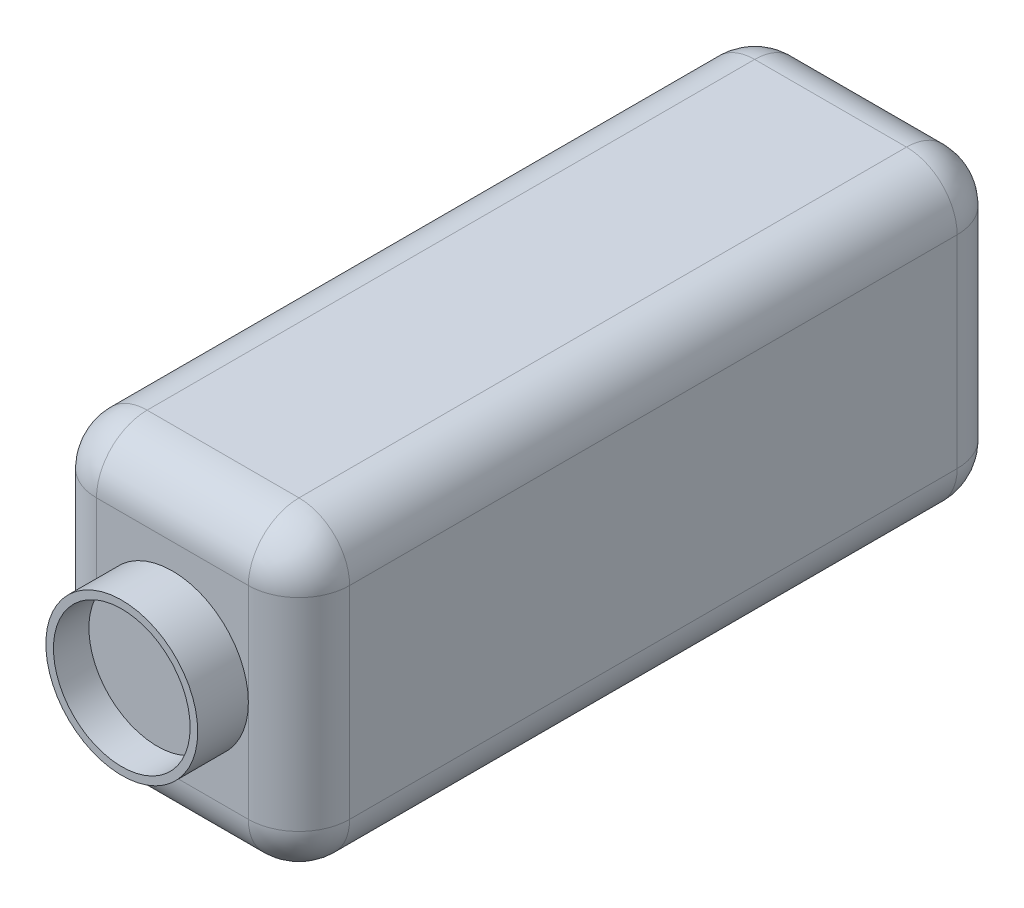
ISO-10303-21;
HEADER;
FILE_DESCRIPTION(('STEP AP214'),'2;1');
FILE_NAME('part.step','',(''),(''),'','','');
FILE_SCHEMA(('AUTOMOTIVE_DESIGN { 1 0 10303 214 1 1 1 1 }'));
ENDSEC;
DATA;
#1=APPLICATION_CONTEXT('core data for automotive mechanical design processes');
#2=APPLICATION_PROTOCOL_DEFINITION('international standard','automotive_design',2000,#1);
#3=PRODUCT_CONTEXT('',#1,'mechanical');
#4=PRODUCT('Part','Part','',(#3));
#5=PRODUCT_RELATED_PRODUCT_CATEGORY('part','',(#4));
#6=PRODUCT_DEFINITION_FORMATION('','',#4);
#7=PRODUCT_DEFINITION_CONTEXT('part definition',#1,'design');
#8=PRODUCT_DEFINITION('design','',#6,#7);
#9=PRODUCT_DEFINITION_SHAPE('','',#8);
#10=(LENGTH_UNIT() NAMED_UNIT(*) SI_UNIT(.MILLI.,.METRE.));
#11=(NAMED_UNIT(*) PLANE_ANGLE_UNIT() SI_UNIT($,.RADIAN.));
#12=(NAMED_UNIT(*) SI_UNIT($,.STERADIAN.) SOLID_ANGLE_UNIT());
#13=UNCERTAINTY_MEASURE_WITH_UNIT(LENGTH_MEASURE(1.E-05),#10,'distance_accuracy_value','');
#14=(GEOMETRIC_REPRESENTATION_CONTEXT(3) GLOBAL_UNCERTAINTY_ASSIGNED_CONTEXT((#13)) GLOBAL_UNIT_ASSIGNED_CONTEXT((#10,
#11,#12)) REPRESENTATION_CONTEXT('',''));
#15=CARTESIAN_POINT('',(0.,0.,0.));
#16=DIRECTION('',(0.,0.,1.));
#17=DIRECTION('',(1.,0.,0.));
#18=AXIS2_PLACEMENT_3D('',#15,#16,#17);
#19=CARTESIAN_POINT('',(0.,0.,0.));
#20=DIRECTION('',(0.,0.,-1.));
#21=DIRECTION('',(-1.,0.,0.));
#22=AXIS2_PLACEMENT_3D('',#19,#20,#21);
#23=PLANE('',#22);
#24=DIRECTION('',(0.,-1.,0.));
#25=VECTOR('',#24,1.);
#26=CARTESIAN_POINT('',(15.,0.,0.));
#27=LINE('',#26,#25);
#28=CARTESIAN_POINT('',(15.,0.,0.));
#29=VERTEX_POINT('',#28);
#30=CARTESIAN_POINT('',(15.,20.,0.));
#31=VERTEX_POINT('',#30);
#32=EDGE_CURVE('E193',#29,#31,#27,.F.);
#33=ORIENTED_EDGE('',*,*,#32,.T.);
#34=DIRECTION('',(1.,0.,0.));
#35=VECTOR('',#34,1.);
#36=CARTESIAN_POINT('',(0.,20.,0.));
#37=LINE('',#36,#35);
#38=CARTESIAN_POINT('',(-15.,20.,0.));
#39=VERTEX_POINT('',#38);
#40=EDGE_CURVE('E195',#31,#39,#37,.F.);
#41=ORIENTED_EDGE('',*,*,#40,.T.);
#42=DIRECTION('',(0.,1.,0.));
#43=VECTOR('',#42,1.);
#44=CARTESIAN_POINT('',(-15.,0.,0.));
#45=LINE('',#44,#43);
#46=CARTESIAN_POINT('',(-15.,0.,0.));
#47=VERTEX_POINT('',#46);
#48=EDGE_CURVE('E154',#39,#47,#45,.F.);
#49=ORIENTED_EDGE('',*,*,#48,.T.);
#50=CARTESIAN_POINT('',(0.,0.,0.));
#51=DIRECTION('',(0.,0.,1.));
#52=DIRECTION('',(1.,0.,0.));
#53=AXIS2_PLACEMENT_3D('',#50,#51,#52);
#54=CIRCLE('',#53,15.);
#55=EDGE_CURVE('E288',#29,#47,#54,.T.);
#56=ORIENTED_EDGE('',*,*,#55,.F.);
#57=EDGE_LOOP('',(#33,#41,#49,#56));
#58=FACE_BOUND('',#57,.T.);
#59=ADVANCED_FACE('F48',(#58),#23,.F.);
#60=CARTESIAN_POINT('',(0.,0.,10.));
#61=DIRECTION('',(0.,0.,-1.));
#62=DIRECTION('',(-1.,0.,0.));
#63=AXIS2_PLACEMENT_3D('',#60,#61,#62);
#64=CYLINDRICAL_SURFACE('',#63,15.);
#65=CARTESIAN_POINT('',(0.,0.,10.));
#66=DIRECTION('',(0.,0.,1.));
#67=DIRECTION('',(1.,0.,0.));
#68=AXIS2_PLACEMENT_3D('',#65,#66,#67);
#69=CIRCLE('',#68,15.);
#70=CARTESIAN_POINT('',(15.,0.,10.));
#71=VERTEX_POINT('',#70);
#72=EDGE_CURVE('E176',#71,#71,#69,.T.);
#73=ORIENTED_EDGE('',*,*,#72,.F.);
#74=EDGE_LOOP('',(#73));
#75=FACE_BOUND('',#74,.T.);
#76=ORIENTED_EDGE('',*,*,#55,.T.);
#77=EDGE_CURVE('E282',#47,#29,#54,.T.);
#78=ORIENTED_EDGE('',*,*,#77,.T.);
#79=EDGE_LOOP('',(#76,#78));
#80=FACE_BOUND('',#79,.T.);
#81=ADVANCED_FACE('F309',(#75,#80),#64,.T.);
#82=CARTESIAN_POINT('',(0.,0.,10.));
#83=DIRECTION('',(0.,0.,1.));
#84=DIRECTION('',(1.,0.,0.));
#85=AXIS2_PLACEMENT_3D('',#82,#83,#84);
#86=PLANE('',#85);
#87=CARTESIAN_POINT('',(0.,0.,10.));
#88=DIRECTION('',(0.,0.,1.));
#89=DIRECTION('',(1.,0.,0.));
#90=AXIS2_PLACEMENT_3D('',#87,#88,#89);
#91=CIRCLE('',#90,13.5);
#92=CARTESIAN_POINT('',(13.5,0.,9.99999999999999));
#93=VERTEX_POINT('',#92);
#94=EDGE_CURVE('E294',#93,#93,#91,.T.);
#95=ORIENTED_EDGE('',*,*,#94,.F.);
#96=EDGE_LOOP('',(#95));
#97=FACE_BOUND('',#96,.T.);
#98=ORIENTED_EDGE('',*,*,#72,.T.);
#99=EDGE_LOOP('',(#98));
#100=FACE_BOUND('',#99,.T.);
#101=ADVANCED_FACE('F306',(#97,#100),#86,.T.);
#102=CARTESIAN_POINT('',(0.,0.,-38.1837661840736));
#103=DIRECTION('',(0.,0.,1.));
#104=DIRECTION('',(1.,0.,0.));
#105=AXIS2_PLACEMENT_3D('',#102,#103,#104);
#106=CYLINDRICAL_SURFACE('',#105,13.5);
#107=CARTESIAN_POINT('',(0.,0.,3.));
#108=DIRECTION('',(0.,0.,1.));
#109=DIRECTION('',(1.,0.,0.));
#110=AXIS2_PLACEMENT_3D('',#107,#108,#109);
#111=CIRCLE('',#110,13.5);
#112=CARTESIAN_POINT('',(13.5,0.,3.));
#113=VERTEX_POINT('',#112);
#114=EDGE_CURVE('E298',#113,#113,#111,.F.);
#115=CARTESIAN_POINT('',(13.5,0.,3.));
#116=CARTESIAN_POINT('',(13.5,0.,3.07291666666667));
#117=CARTESIAN_POINT('',(13.5,0.,3.14583333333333));
#118=CARTESIAN_POINT('',(13.5,0.,3.29166666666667));
#119=CARTESIAN_POINT('',(13.5,0.,3.36458333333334));
#120=CARTESIAN_POINT('',(13.5,0.,3.51041666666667));
#121=CARTESIAN_POINT('',(13.5,0.,3.58333333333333));
#122=CARTESIAN_POINT('',(13.5,0.,3.72916666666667));
#123=CARTESIAN_POINT('',(13.5,0.,3.80208333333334));
#124=CARTESIAN_POINT('',(13.5,0.,3.94791666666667));
#125=CARTESIAN_POINT('',(13.5,0.,4.02083333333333));
#126=CARTESIAN_POINT('',(13.5,0.,4.16666666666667));
#127=CARTESIAN_POINT('',(13.5,0.,4.23958333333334));
#128=CARTESIAN_POINT('',(13.5,0.,4.38541666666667));
#129=CARTESIAN_POINT('',(13.5,0.,4.45833333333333));
#130=CARTESIAN_POINT('',(13.5,0.,4.60416666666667));
#131=CARTESIAN_POINT('',(13.5,0.,4.67708333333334));
#132=CARTESIAN_POINT('',(13.5,0.,4.82291666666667));
#133=CARTESIAN_POINT('',(13.5,0.,4.89583333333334));
#134=CARTESIAN_POINT('',(13.5,0.,5.04166666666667));
#135=CARTESIAN_POINT('',(13.5,0.,5.11458333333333));
#136=CARTESIAN_POINT('',(13.5,0.,5.26041666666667));
#137=CARTESIAN_POINT('',(13.5,0.,5.33333333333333));
#138=CARTESIAN_POINT('',(13.5,0.,5.47916666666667));
#139=CARTESIAN_POINT('',(13.5,0.,5.55208333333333));
#140=CARTESIAN_POINT('',(13.5,0.,5.69791666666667));
#141=CARTESIAN_POINT('',(13.5,0.,5.77083333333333));
#142=CARTESIAN_POINT('',(13.5,0.,5.91666666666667));
#143=CARTESIAN_POINT('',(13.5,0.,5.98958333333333));
#144=CARTESIAN_POINT('',(13.5,0.,6.13541666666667));
#145=CARTESIAN_POINT('',(13.5,0.,6.20833333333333));
#146=CARTESIAN_POINT('',(13.5,0.,6.35416666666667));
#147=CARTESIAN_POINT('',(13.5,0.,6.42708333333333));
#148=CARTESIAN_POINT('',(13.5,0.,6.57291666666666));
#149=CARTESIAN_POINT('',(13.5,0.,6.64583333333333));
#150=CARTESIAN_POINT('',(13.5,0.,6.79166666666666));
#151=CARTESIAN_POINT('',(13.5,0.,6.86458333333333));
#152=CARTESIAN_POINT('',(13.5,0.,7.01041666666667));
#153=CARTESIAN_POINT('',(13.5,0.,7.08333333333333));
#154=CARTESIAN_POINT('',(13.5,0.,7.22916666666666));
#155=CARTESIAN_POINT('',(13.5,0.,7.30208333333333));
#156=CARTESIAN_POINT('',(13.5,0.,7.44791666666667));
#157=CARTESIAN_POINT('',(13.5,0.,7.52083333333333));
#158=CARTESIAN_POINT('',(13.5,0.,7.66666666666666));
#159=CARTESIAN_POINT('',(13.5,0.,7.73958333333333));
#160=CARTESIAN_POINT('',(13.5,0.,7.88541666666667));
#161=CARTESIAN_POINT('',(13.5,0.,7.95833333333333));
#162=CARTESIAN_POINT('',(13.5,0.,8.10416666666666));
#163=CARTESIAN_POINT('',(13.5,0.,8.17708333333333));
#164=CARTESIAN_POINT('',(13.5,0.,8.32291666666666));
#165=CARTESIAN_POINT('',(13.5,0.,8.39583333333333));
#166=CARTESIAN_POINT('',(13.5,0.,8.54166666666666));
#167=CARTESIAN_POINT('',(13.5,0.,8.61458333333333));
#168=CARTESIAN_POINT('',(13.5,0.,8.76041666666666));
#169=CARTESIAN_POINT('',(13.5,0.,8.83333333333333));
#170=CARTESIAN_POINT('',(13.5,0.,8.97916666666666));
#171=CARTESIAN_POINT('',(13.5,0.,9.05208333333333));
#172=CARTESIAN_POINT('',(13.5,0.,9.19791666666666));
#173=CARTESIAN_POINT('',(13.5,0.,9.27083333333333));
#174=CARTESIAN_POINT('',(13.5,0.,9.41666666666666));
#175=CARTESIAN_POINT('',(13.5,0.,9.48958333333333));
#176=CARTESIAN_POINT('',(13.5,0.,9.63541666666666));
#177=CARTESIAN_POINT('',(13.5,0.,9.70833333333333));
#178=CARTESIAN_POINT('',(13.5,0.,9.85416666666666));
#179=CARTESIAN_POINT('',(13.5,0.,9.92708333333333));
#180=CARTESIAN_POINT('',(13.5,0.,9.99999999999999));
#181=B_SPLINE_CURVE_WITH_KNOTS('',3,(#115,#116,#117,#118,#119,#120,#121,#122,#123,#124,#125,
#126,#127,#128,#129,#130,#131,#132,#133,#134,#135,#136,#137,#138,#139,#140,#141,#142,#143,#144,
#145,#146,#147,#148,#149,#150,#151,#152,#153,#154,#155,#156,#157,#158,#159,#160,#161,#162,#163,
#164,#165,#166,#167,#168,#169,#170,#171,#172,#173,#174,#175,#176,#177,#178,#179,#180),
.UNSPECIFIED.,.F.,.F.,(4,2,2,2,2,2,2,2,2,2,2,2,2,2,2,2,2,2,2,2,2,2,2,2,2,2,2,2,2,2,2,2,4),(0.,
0.218749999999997,0.4375,0.656249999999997,0.875000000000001,1.09375,1.3125,1.53125,1.75,
1.96875,2.1875,2.40625,2.625,2.84375,3.0625,3.28125,3.5,3.71874999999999,3.9375,
4.15624999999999,4.375,4.59374999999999,4.8125,5.03124999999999,5.24999999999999,
5.46874999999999,5.68749999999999,5.90624999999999,6.12499999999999,6.34375,6.56249999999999,
6.78124999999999,6.99999999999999),.UNSPECIFIED.);
#182=EDGE_CURVE('BSEAM304',#113,#93,#181,.T.);
#183=ORIENTED_EDGE('',*,*,#114,.T.);
#184=ORIENTED_EDGE('',*,*,#94,.T.);
#185=ORIENTED_EDGE('',*,*,#182,.T.);
#186=ORIENTED_EDGE('',*,*,#182,.F.);
#187=EDGE_LOOP('',(#183,#185,#184,#186));
#188=FACE_BOUND('',#187,.T.);
#189=ADVANCED_FACE('F304',(#188),#106,.F.);
#190=CARTESIAN_POINT('',(0.,0.,3.));
#191=DIRECTION('',(0.,0.,1.));
#192=DIRECTION('',(1.,0.,0.));
#193=AXIS2_PLACEMENT_3D('',#190,#191,#192);
#194=PLANE('',#193);
#195=ORIENTED_EDGE('',*,*,#114,.F.);
#196=EDGE_LOOP('',(#195));
#197=FACE_BOUND('',#196,.T.);
#198=ADVANCED_FACE('F441',(#197),#194,.T.);
#199=CARTESIAN_POINT('',(-25.,30.,-140.));
#200=DIRECTION('',(1.,0.,0.));
#201=DIRECTION('',(0.,1.,0.));
#202=AXIS2_PLACEMENT_3D('',#199,#200,#201);
#203=PLANE('',#202);
#204=DIRECTION('',(0.,1.,0.));
#205=VECTOR('',#204,1.);
#206=CARTESIAN_POINT('',(-25.,-30.,-130.));
#207=LINE('',#206,#205);
#208=CARTESIAN_POINT('',(-25.,20.,-130.));
#209=VERTEX_POINT('',#208);
#210=CARTESIAN_POINT('',(-25.,-20.,-130.));
#211=VERTEX_POINT('',#210);
#212=EDGE_CURVE('E175',#209,#211,#207,.F.);
#213=ORIENTED_EDGE('',*,*,#212,.T.);
#214=DIRECTION('',(0.,0.,1.));
#215=VECTOR('',#214,1.);
#216=CARTESIAN_POINT('',(-25.,-20.,-140.));
#217=LINE('',#216,#215);
#218=CARTESIAN_POINT('',(-25.,-20.,-10.));
#219=VERTEX_POINT('',#218);
#220=EDGE_CURVE('E180',#211,#219,#217,.T.);
#221=ORIENTED_EDGE('',*,*,#220,.T.);
#222=DIRECTION('',(0.,1.,0.));
#223=VECTOR('',#222,1.);
#224=CARTESIAN_POINT('',(-25.,30.,-10.));
#225=LINE('',#224,#223);
#226=CARTESIAN_POINT('',(-25.,20.,-10.));
#227=VERTEX_POINT('',#226);
#228=EDGE_CURVE('E152',#219,#227,#225,.T.);
#229=ORIENTED_EDGE('',*,*,#228,.T.);
#230=DIRECTION('',(0.,0.,1.));
#231=VECTOR('',#230,1.);
#232=CARTESIAN_POINT('',(-25.,20.,-140.));
#233=LINE('',#232,#231);
#234=EDGE_CURVE('E170',#227,#209,#233,.F.);
#235=ORIENTED_EDGE('',*,*,#234,.T.);
#236=EDGE_LOOP('',(#213,#221,#229,#235));
#237=FACE_BOUND('',#236,.T.);
#238=ADVANCED_FACE('F178',(#237),#203,.F.);
#239=CARTESIAN_POINT('',(25.,30.,-140.));
#240=DIRECTION('',(0.,-1.,0.));
#241=DIRECTION('',(1.,0.,0.));
#242=AXIS2_PLACEMENT_3D('',#239,#240,#241);
#243=PLANE('',#242);
#244=DIRECTION('',(1.,0.,0.));
#245=VECTOR('',#244,1.);
#246=CARTESIAN_POINT('',(-25.,30.,-130.));
#247=LINE('',#246,#245);
#248=CARTESIAN_POINT('',(15.,30.,-130.));
#249=VERTEX_POINT('',#248);
#250=CARTESIAN_POINT('',(-15.,30.,-130.));
#251=VERTEX_POINT('',#250);
#252=EDGE_CURVE('E199',#249,#251,#247,.F.);
#253=ORIENTED_EDGE('',*,*,#252,.T.);
#254=DIRECTION('',(0.,0.,1.));
#255=VECTOR('',#254,1.);
#256=CARTESIAN_POINT('',(-15.,30.,-140.));
#257=LINE('',#256,#255);
#258=CARTESIAN_POINT('',(-15.,30.,-10.));
#259=VERTEX_POINT('',#258);
#260=EDGE_CURVE('E204',#251,#259,#257,.T.);
#261=ORIENTED_EDGE('',*,*,#260,.T.);
#262=DIRECTION('',(1.,0.,0.));
#263=VECTOR('',#262,1.);
#264=CARTESIAN_POINT('',(25.,30.,-10.));
#265=LINE('',#264,#263);
#266=CARTESIAN_POINT('',(15.,30.,-10.));
#267=VERTEX_POINT('',#266);
#268=EDGE_CURVE('E201',#259,#267,#265,.T.);
#269=ORIENTED_EDGE('',*,*,#268,.T.);
#270=DIRECTION('',(0.,0.,1.));
#271=VECTOR('',#270,1.);
#272=CARTESIAN_POINT('',(15.,30.,-140.));
#273=LINE('',#272,#271);
#274=EDGE_CURVE('E197',#267,#249,#273,.F.);
#275=ORIENTED_EDGE('',*,*,#274,.T.);
#276=EDGE_LOOP('',(#253,#261,#269,#275));
#277=FACE_BOUND('',#276,.T.);
#278=ADVANCED_FACE('F333',(#277),#243,.F.);
#279=CARTESIAN_POINT('',(25.,30.,-140.));
#280=DIRECTION('',(-1.,0.,0.));
#281=DIRECTION('',(0.,-1.,0.));
#282=AXIS2_PLACEMENT_3D('',#279,#280,#281);
#283=PLANE('',#282);
#284=DIRECTION('',(0.,-1.,0.));
#285=VECTOR('',#284,1.);
#286=CARTESIAN_POINT('',(25.,30.,-10.));
#287=LINE('',#286,#285);
#288=CARTESIAN_POINT('',(25.,20.,-10.));
#289=VERTEX_POINT('',#288);
#290=CARTESIAN_POINT('',(25.,-20.,-10.));
#291=VERTEX_POINT('',#290);
#292=EDGE_CURVE('E210',#289,#291,#287,.T.);
#293=ORIENTED_EDGE('',*,*,#292,.T.);
#294=DIRECTION('',(0.,0.,1.));
#295=VECTOR('',#294,1.);
#296=CARTESIAN_POINT('',(25.,-20.,-140.));
#297=LINE('',#296,#295);
#298=CARTESIAN_POINT('',(25.,-20.,-130.));
#299=VERTEX_POINT('',#298);
#300=EDGE_CURVE('E213',#291,#299,#297,.F.);
#301=ORIENTED_EDGE('',*,*,#300,.T.);
#302=DIRECTION('',(0.,-1.,0.));
#303=VECTOR('',#302,1.);
#304=CARTESIAN_POINT('',(25.,30.,-130.));
#305=LINE('',#304,#303);
#306=CARTESIAN_POINT('',(25.,20.,-130.));
#307=VERTEX_POINT('',#306);
#308=EDGE_CURVE('E208',#299,#307,#305,.F.);
#309=ORIENTED_EDGE('',*,*,#308,.T.);
#310=DIRECTION('',(0.,0.,1.));
#311=VECTOR('',#310,1.);
#312=CARTESIAN_POINT('',(25.,20.,-140.));
#313=LINE('',#312,#311);
#314=EDGE_CURVE('E206',#307,#289,#313,.T.);
#315=ORIENTED_EDGE('',*,*,#314,.T.);
#316=EDGE_LOOP('',(#293,#301,#309,#315));
#317=FACE_BOUND('',#316,.T.);
#318=ADVANCED_FACE('F369',(#317),#283,.F.);
#319=CARTESIAN_POINT('',(25.,-30.,-140.));
#320=DIRECTION('',(0.,1.,0.));
#321=DIRECTION('',(0.,0.,1.));
#322=AXIS2_PLACEMENT_3D('',#319,#320,#321);
#323=PLANE('',#322);
#324=DIRECTION('',(-1.,0.,0.));
#325=VECTOR('',#324,1.);
#326=CARTESIAN_POINT('',(25.,-30.,-10.));
#327=LINE('',#326,#325);
#328=CARTESIAN_POINT('',(15.,-30.,-10.));
#329=VERTEX_POINT('',#328);
#330=CARTESIAN_POINT('',(-15.,-30.,-10.));
#331=VERTEX_POINT('',#330);
#332=EDGE_CURVE('E219',#329,#331,#327,.T.);
#333=ORIENTED_EDGE('',*,*,#332,.T.);
#334=DIRECTION('',(0.,0.,1.));
#335=VECTOR('',#334,1.);
#336=CARTESIAN_POINT('',(-15.,-30.,-140.));
#337=LINE('',#336,#335);
#338=CARTESIAN_POINT('',(-15.,-30.,-130.));
#339=VERTEX_POINT('',#338);
#340=EDGE_CURVE('E222',#331,#339,#337,.F.);
#341=ORIENTED_EDGE('',*,*,#340,.T.);
#342=DIRECTION('',(-1.,0.,0.));
#343=VECTOR('',#342,1.);
#344=CARTESIAN_POINT('',(25.,-30.,-130.));
#345=LINE('',#344,#343);
#346=CARTESIAN_POINT('',(15.,-30.,-130.));
#347=VERTEX_POINT('',#346);
#348=EDGE_CURVE('E217',#339,#347,#345,.F.);
#349=ORIENTED_EDGE('',*,*,#348,.T.);
#350=DIRECTION('',(0.,0.,1.));
#351=VECTOR('',#350,1.);
#352=CARTESIAN_POINT('',(15.,-30.,-140.));
#353=LINE('',#352,#351);
#354=EDGE_CURVE('E215',#347,#329,#353,.T.);
#355=ORIENTED_EDGE('',*,*,#354,.T.);
#356=EDGE_LOOP('',(#333,#341,#349,#355));
#357=FACE_BOUND('',#356,.T.);
#358=ADVANCED_FACE('F396',(#357),#323,.F.);
#359=CARTESIAN_POINT('',(0.,0.,-140.));
#360=DIRECTION('',(0.,0.,-1.));
#361=DIRECTION('',(-1.,0.,0.));
#362=AXIS2_PLACEMENT_3D('',#359,#360,#361);
#363=PLANE('',#362);
#364=DIRECTION('',(-1.,0.,0.));
#365=VECTOR('',#364,1.);
#366=CARTESIAN_POINT('',(-25.,-20.,-140.));
#367=LINE('',#366,#365);
#368=CARTESIAN_POINT('',(15.,-20.,-140.));
#369=VERTEX_POINT('',#368);
#370=CARTESIAN_POINT('',(-15.,-20.,-140.));
#371=VERTEX_POINT('',#370);
#372=EDGE_CURVE('E224',#369,#371,#367,.T.);
#373=ORIENTED_EDGE('',*,*,#372,.T.);
#374=DIRECTION('',(0.,1.,0.));
#375=VECTOR('',#374,1.);
#376=CARTESIAN_POINT('',(-15.,30.,-140.));
#377=LINE('',#376,#375);
#378=CARTESIAN_POINT('',(-15.,20.,-140.));
#379=VERTEX_POINT('',#378);
#380=EDGE_CURVE('E14',#371,#379,#377,.T.);
#381=ORIENTED_EDGE('',*,*,#380,.T.);
#382=DIRECTION('',(1.,0.,0.));
#383=VECTOR('',#382,1.);
#384=CARTESIAN_POINT('',(25.,20.,-140.));
#385=LINE('',#384,#383);
#386=CARTESIAN_POINT('',(15.,20.,-140.));
#387=VERTEX_POINT('',#386);
#388=EDGE_CURVE('E57',#379,#387,#385,.T.);
#389=ORIENTED_EDGE('',*,*,#388,.T.);
#390=DIRECTION('',(0.,-1.,0.));
#391=VECTOR('',#390,1.);
#392=CARTESIAN_POINT('',(15.,-30.,-140.));
#393=LINE('',#392,#391);
#394=EDGE_CURVE('E226',#387,#369,#393,.T.);
#395=ORIENTED_EDGE('',*,*,#394,.T.);
#396=EDGE_LOOP('',(#373,#381,#389,#395));
#397=FACE_BOUND('',#396,.T.);
#398=ADVANCED_FACE('F390',(#397),#363,.T.);
#399=ORIENTED_EDGE('',*,*,#77,.F.);
#400=DIRECTION('',(0.,1.,0.));
#401=VECTOR('',#400,1.);
#402=CARTESIAN_POINT('',(-15.,0.,0.));
#403=LINE('',#402,#401);
#404=CARTESIAN_POINT('',(-15.,-20.,0.));
#405=VERTEX_POINT('',#404);
#406=EDGE_CURVE('E190',#47,#405,#403,.F.);
#407=ORIENTED_EDGE('',*,*,#406,.T.);
#408=DIRECTION('',(-1.,0.,0.));
#409=VECTOR('',#408,1.);
#410=CARTESIAN_POINT('',(0.,-20.,0.));
#411=LINE('',#410,#409);
#412=CARTESIAN_POINT('',(15.,-20.,0.));
#413=VERTEX_POINT('',#412);
#414=EDGE_CURVE('E183',#405,#413,#411,.F.);
#415=ORIENTED_EDGE('',*,*,#414,.T.);
#416=DIRECTION('',(0.,-1.,0.));
#417=VECTOR('',#416,1.);
#418=CARTESIAN_POINT('',(15.,0.,0.));
#419=LINE('',#418,#417);
#420=EDGE_CURVE('E188',#413,#29,#419,.F.);
#421=ORIENTED_EDGE('',*,*,#420,.T.);
#422=EDGE_LOOP('',(#399,#407,#415,#421));
#423=FACE_BOUND('',#422,.T.);
#424=ADVANCED_FACE('F355',(#423),#23,.F.);
#425=CARTESIAN_POINT('',(15.,0.,-130.));
#426=DIRECTION('',(0.,1.,0.));
#427=DIRECTION('',(-1.,0.,0.));
#428=AXIS2_PLACEMENT_3D('',#425,#426,#427);
#429=CYLINDRICAL_SURFACE('',#428,10.);
#430=CARTESIAN_POINT('',(15.,-20.,-130.));
#431=DIRECTION('',(0.,-1.,0.));
#432=DIRECTION('',(0.,0.,-1.));
#433=AXIS2_PLACEMENT_3D('',#430,#431,#432);
#434=CIRCLE('',#433,10.);
#435=EDGE_CURVE('E52',#369,#299,#434,.T.);
#436=ORIENTED_EDGE('',*,*,#435,.F.);
#437=ORIENTED_EDGE('',*,*,#394,.F.);
#438=CARTESIAN_POINT('',(15.,20.,-130.));
#439=DIRECTION('',(0.,1.,0.));
#440=DIRECTION('',(0.,0.,1.));
#441=AXIS2_PLACEMENT_3D('',#438,#439,#440);
#442=CIRCLE('',#441,10.);
#443=EDGE_CURVE('E275',#307,#387,#442,.T.);
#444=ORIENTED_EDGE('',*,*,#443,.F.);
#445=ORIENTED_EDGE('',*,*,#308,.F.);
#446=EDGE_LOOP('',(#436,#437,#444,#445));
#447=FACE_BOUND('',#446,.T.);
#448=ADVANCED_FACE('F50',(#447),#429,.T.);
#449=CARTESIAN_POINT('',(15.,-20.,-130.));
#450=DIRECTION('',(0.,0.,1.));
#451=DIRECTION('',(1.,0.,0.));
#452=AXIS2_PLACEMENT_3D('',#449,#450,#451);
#453=SPHERICAL_SURFACE('',#452,10.);
#454=CARTESIAN_POINT('',(15.,-20.,-130.));
#455=DIRECTION('',(1.,0.,0.));
#456=DIRECTION('',(0.,0.,-1.));
#457=AXIS2_PLACEMENT_3D('',#454,#455,#456);
#458=CIRCLE('',#457,10.);
#459=EDGE_CURVE('E270',#369,#347,#458,.F.);
#460=ORIENTED_EDGE('',*,*,#459,.F.);
#461=ORIENTED_EDGE('',*,*,#435,.T.);
#462=CARTESIAN_POINT('',(15.,-20.,-130.));
#463=DIRECTION('',(0.,0.,-1.));
#464=DIRECTION('',(-1.,0.,0.));
#465=AXIS2_PLACEMENT_3D('',#462,#463,#464);
#466=CIRCLE('',#465,10.);
#467=EDGE_CURVE('E273',#347,#299,#466,.F.);
#468=ORIENTED_EDGE('',*,*,#467,.F.);
#469=EDGE_LOOP('',(#460,#461,#468));
#470=FACE_BOUND('',#469,.T.);
#471=ADVANCED_FACE('F375',(#470),#453,.T.);
#472=CARTESIAN_POINT('',(15.,20.,-130.));
#473=DIRECTION('',(0.,0.,1.));
#474=DIRECTION('',(1.,0.,0.));
#475=AXIS2_PLACEMENT_3D('',#472,#473,#474);
#476=SPHERICAL_SURFACE('',#475,10.);
#477=CARTESIAN_POINT('',(15.,20.,-130.));
#478=DIRECTION('',(0.,0.,-1.));
#479=DIRECTION('',(-1.,0.,0.));
#480=AXIS2_PLACEMENT_3D('',#477,#478,#479);
#481=CIRCLE('',#480,10.);
#482=EDGE_CURVE('E264',#307,#249,#481,.F.);
#483=ORIENTED_EDGE('',*,*,#482,.F.);
#484=ORIENTED_EDGE('',*,*,#443,.T.);
#485=CARTESIAN_POINT('',(15.,20.,-130.));
#486=DIRECTION('',(1.,0.,0.));
#487=DIRECTION('',(0.,0.,-1.));
#488=AXIS2_PLACEMENT_3D('',#485,#486,#487);
#489=CIRCLE('',#488,10.);
#490=EDGE_CURVE('E267',#249,#387,#489,.F.);
#491=ORIENTED_EDGE('',*,*,#490,.F.);
#492=EDGE_LOOP('',(#483,#484,#491));
#493=FACE_BOUND('',#492,.T.);
#494=ADVANCED_FACE('F373',(#493),#476,.T.);
#495=CARTESIAN_POINT('',(15.,-20.,-140.));
#496=DIRECTION('',(0.,0.,1.));
#497=DIRECTION('',(1.,0.,0.));
#498=AXIS2_PLACEMENT_3D('',#495,#496,#497);
#499=CYLINDRICAL_SURFACE('',#498,10.);
#500=ORIENTED_EDGE('',*,*,#467,.T.);
#501=ORIENTED_EDGE('',*,*,#300,.F.);
#502=CARTESIAN_POINT('',(15.,-20.,-10.));
#503=DIRECTION('',(0.,0.,1.));
#504=DIRECTION('',(1.,0.,0.));
#505=AXIS2_PLACEMENT_3D('',#502,#503,#504);
#506=CIRCLE('',#505,10.);
#507=EDGE_CURVE('E259',#329,#291,#506,.T.);
#508=ORIENTED_EDGE('',*,*,#507,.F.);
#509=ORIENTED_EDGE('',*,*,#354,.F.);
#510=EDGE_LOOP('',(#500,#501,#508,#509));
#511=FACE_BOUND('',#510,.T.);
#512=ADVANCED_FACE('F365',(#511),#499,.T.);
#513=CARTESIAN_POINT('',(0.,-20.,-130.));
#514=DIRECTION('',(1.,0.,0.));
#515=DIRECTION('',(0.,0.,-1.));
#516=AXIS2_PLACEMENT_3D('',#513,#514,#515);
#517=CYLINDRICAL_SURFACE('',#516,10.);
#518=ORIENTED_EDGE('',*,*,#459,.T.);
#519=ORIENTED_EDGE('',*,*,#348,.F.);
#520=CARTESIAN_POINT('',(-15.,-20.,-130.));
#521=DIRECTION('',(-1.,0.,0.));
#522=DIRECTION('',(0.,0.,1.));
#523=AXIS2_PLACEMENT_3D('',#520,#521,#522);
#524=CIRCLE('',#523,10.);
#525=EDGE_CURVE('E256',#371,#339,#524,.T.);
#526=ORIENTED_EDGE('',*,*,#525,.F.);
#527=ORIENTED_EDGE('',*,*,#372,.F.);
#528=EDGE_LOOP('',(#518,#519,#526,#527));
#529=FACE_BOUND('',#528,.T.);
#530=ADVANCED_FACE('F381',(#529),#517,.T.);
#531=CARTESIAN_POINT('',(-15.,0.,-130.));
#532=DIRECTION('',(0.,-1.,0.));
#533=DIRECTION('',(1.,0.,0.));
#534=AXIS2_PLACEMENT_3D('',#531,#532,#533);
#535=CYLINDRICAL_SURFACE('',#534,10.);
#536=CARTESIAN_POINT('',(-15.,20.,-130.));
#537=DIRECTION('',(0.,1.,0.));
#538=DIRECTION('',(0.,0.,1.));
#539=AXIS2_PLACEMENT_3D('',#536,#537,#538);
#540=CIRCLE('',#539,10.);
#541=EDGE_CURVE('E251',#379,#209,#540,.T.);
#542=ORIENTED_EDGE('',*,*,#541,.F.);
#543=ORIENTED_EDGE('',*,*,#380,.F.);
#544=CARTESIAN_POINT('',(-15.,-20.,-130.));
#545=DIRECTION('',(0.,-1.,0.));
#546=DIRECTION('',(0.,0.,-1.));
#547=AXIS2_PLACEMENT_3D('',#544,#545,#546);
#548=CIRCLE('',#547,10.);
#549=EDGE_CURVE('E253',#211,#371,#548,.T.);
#550=ORIENTED_EDGE('',*,*,#549,.F.);
#551=ORIENTED_EDGE('',*,*,#212,.F.);
#552=EDGE_LOOP('',(#542,#543,#550,#551));
#553=FACE_BOUND('',#552,.T.);
#554=ADVANCED_FACE('F340',(#553),#535,.T.);
#555=CARTESIAN_POINT('',(0.,20.,-130.));
#556=DIRECTION('',(-1.,0.,0.));
#557=DIRECTION('',(0.,-1.,0.));
#558=AXIS2_PLACEMENT_3D('',#555,#556,#557);
#559=CYLINDRICAL_SURFACE('',#558,10.);
#560=ORIENTED_EDGE('',*,*,#490,.T.);
#561=ORIENTED_EDGE('',*,*,#388,.F.);
#562=CARTESIAN_POINT('',(-15.,20.,-130.));
#563=DIRECTION('',(-1.,0.,0.));
#564=DIRECTION('',(0.,0.,1.));
#565=AXIS2_PLACEMENT_3D('',#562,#563,#564);
#566=CIRCLE('',#565,10.);
#567=EDGE_CURVE('E65',#251,#379,#566,.T.);
#568=ORIENTED_EDGE('',*,*,#567,.F.);
#569=ORIENTED_EDGE('',*,*,#252,.F.);
#570=EDGE_LOOP('',(#560,#561,#568,#569));
#571=FACE_BOUND('',#570,.T.);
#572=ADVANCED_FACE('F336',(#571),#559,.T.);
#573=CARTESIAN_POINT('',(15.,20.,-140.));
#574=DIRECTION('',(0.,0.,1.));
#575=DIRECTION('',(1.,0.,0.));
#576=AXIS2_PLACEMENT_3D('',#573,#574,#575);
#577=CYLINDRICAL_SURFACE('',#576,10.);
#578=ORIENTED_EDGE('',*,*,#482,.T.);
#579=ORIENTED_EDGE('',*,*,#274,.F.);
#580=CARTESIAN_POINT('',(15.,20.,-10.));
#581=DIRECTION('',(0.,0.,1.));
#582=DIRECTION('',(1.,0.,0.));
#583=AXIS2_PLACEMENT_3D('',#580,#581,#582);
#584=CIRCLE('',#583,10.);
#585=EDGE_CURVE('E247',#289,#267,#584,.T.);
#586=ORIENTED_EDGE('',*,*,#585,.F.);
#587=ORIENTED_EDGE('',*,*,#314,.F.);
#588=EDGE_LOOP('',(#578,#579,#586,#587));
#589=FACE_BOUND('',#588,.T.);
#590=ADVANCED_FACE('F372',(#589),#577,.T.);
#591=CARTESIAN_POINT('',(15.,30.,-10.));
#592=DIRECTION('',(0.,-1.,0.));
#593=DIRECTION('',(1.,0.,0.));
#594=AXIS2_PLACEMENT_3D('',#591,#592,#593);
#595=CYLINDRICAL_SURFACE('',#594,10.);
#596=CARTESIAN_POINT('',(15.,-20.,-10.));
#597=DIRECTION('',(0.,-1.,0.));
#598=DIRECTION('',(0.,0.,-1.));
#599=AXIS2_PLACEMENT_3D('',#596,#597,#598);
#600=CIRCLE('',#599,10.);
#601=EDGE_CURVE('E261',#291,#413,#600,.T.);
#602=ORIENTED_EDGE('',*,*,#601,.F.);
#603=ORIENTED_EDGE('',*,*,#292,.F.);
#604=CARTESIAN_POINT('',(15.,20.,-10.));
#605=DIRECTION('',(0.,1.,0.));
#606=DIRECTION('',(0.,0.,1.));
#607=AXIS2_PLACEMENT_3D('',#604,#605,#606);
#608=CIRCLE('',#607,10.);
#609=EDGE_CURVE('E244',#31,#289,#608,.T.);
#610=ORIENTED_EDGE('',*,*,#609,.F.);
#611=ORIENTED_EDGE('',*,*,#32,.F.);
#612=ORIENTED_EDGE('',*,*,#420,.F.);
#613=EDGE_LOOP('',(#602,#603,#610,#611,#612));
#614=FACE_BOUND('',#613,.T.);
#615=ADVANCED_FACE('F321',(#614),#595,.T.);
#616=CARTESIAN_POINT('',(15.,-20.,-10.));
#617=DIRECTION('',(0.,0.,1.));
#618=DIRECTION('',(1.,0.,0.));
#619=AXIS2_PLACEMENT_3D('',#616,#617,#618);
#620=SPHERICAL_SURFACE('',#619,10.);
#621=ORIENTED_EDGE('',*,*,#507,.T.);
#622=ORIENTED_EDGE('',*,*,#601,.T.);
#623=CARTESIAN_POINT('',(15.,-20.,-10.));
#624=DIRECTION('',(1.,0.,0.));
#625=DIRECTION('',(0.,0.,-1.));
#626=AXIS2_PLACEMENT_3D('',#623,#624,#625);
#627=CIRCLE('',#626,10.);
#628=EDGE_CURVE('E241',#329,#413,#627,.F.);
#629=ORIENTED_EDGE('',*,*,#628,.F.);
#630=EDGE_LOOP('',(#621,#622,#629));
#631=FACE_BOUND('',#630,.T.);
#632=ADVANCED_FACE('F361',(#631),#620,.T.);
#633=CARTESIAN_POINT('',(-15.,-20.,-130.));
#634=DIRECTION('',(0.,0.,1.));
#635=DIRECTION('',(1.,0.,0.));
#636=AXIS2_PLACEMENT_3D('',#633,#634,#635);
#637=SPHERICAL_SURFACE('',#636,10.);
#638=ORIENTED_EDGE('',*,*,#549,.T.);
#639=ORIENTED_EDGE('',*,*,#525,.T.);
#640=CARTESIAN_POINT('',(-15.,-20.,-130.));
#641=DIRECTION('',(0.,0.,-1.));
#642=DIRECTION('',(-1.,0.,0.));
#643=AXIS2_PLACEMENT_3D('',#640,#641,#642);
#644=CIRCLE('',#643,10.);
#645=EDGE_CURVE('E238',#211,#339,#644,.F.);
#646=ORIENTED_EDGE('',*,*,#645,.F.);
#647=EDGE_LOOP('',(#638,#639,#646));
#648=FACE_BOUND('',#647,.T.);
#649=ADVANCED_FACE('F345',(#648),#637,.T.);
#650=CARTESIAN_POINT('',(-15.,20.,-130.));
#651=DIRECTION('',(0.,0.,1.));
#652=DIRECTION('',(1.,0.,0.));
#653=AXIS2_PLACEMENT_3D('',#650,#651,#652);
#654=SPHERICAL_SURFACE('',#653,10.);
#655=ORIENTED_EDGE('',*,*,#567,.T.);
#656=ORIENTED_EDGE('',*,*,#541,.T.);
#657=CARTESIAN_POINT('',(-15.,20.,-130.));
#658=DIRECTION('',(0.,0.,-1.));
#659=DIRECTION('',(-1.,0.,0.));
#660=AXIS2_PLACEMENT_3D('',#657,#658,#659);
#661=CIRCLE('',#660,10.);
#662=EDGE_CURVE('E172',#251,#209,#661,.F.);
#663=ORIENTED_EDGE('',*,*,#662,.F.);
#664=EDGE_LOOP('',(#655,#656,#663));
#665=FACE_BOUND('',#664,.T.);
#666=ADVANCED_FACE('F337',(#665),#654,.T.);
#667=CARTESIAN_POINT('',(15.,20.,-10.));
#668=DIRECTION('',(0.,0.,1.));
#669=DIRECTION('',(1.,0.,0.));
#670=AXIS2_PLACEMENT_3D('',#667,#668,#669);
#671=SPHERICAL_SURFACE('',#670,10.);
#672=ORIENTED_EDGE('',*,*,#609,.T.);
#673=ORIENTED_EDGE('',*,*,#585,.T.);
#674=CARTESIAN_POINT('',(15.,20.,-10.));
#675=DIRECTION('',(1.,0.,0.));
#676=DIRECTION('',(0.,0.,-1.));
#677=AXIS2_PLACEMENT_3D('',#674,#675,#676);
#678=CIRCLE('',#677,10.);
#679=EDGE_CURVE('E235',#31,#267,#678,.F.);
#680=ORIENTED_EDGE('',*,*,#679,.F.);
#681=EDGE_LOOP('',(#672,#673,#680));
#682=FACE_BOUND('',#681,.T.);
#683=ADVANCED_FACE('F327',(#682),#671,.T.);
#684=CARTESIAN_POINT('',(25.,-20.,-10.));
#685=DIRECTION('',(-1.,0.,0.));
#686=DIRECTION('',(0.,0.,1.));
#687=AXIS2_PLACEMENT_3D('',#684,#685,#686);
#688=CYLINDRICAL_SURFACE('',#687,10.);
#689=ORIENTED_EDGE('',*,*,#628,.T.);
#690=ORIENTED_EDGE('',*,*,#414,.F.);
#691=CARTESIAN_POINT('',(-15.,-20.,-10.));
#692=DIRECTION('',(-1.,0.,0.));
#693=DIRECTION('',(0.,0.,1.));
#694=AXIS2_PLACEMENT_3D('',#691,#692,#693);
#695=CIRCLE('',#694,10.);
#696=EDGE_CURVE('E232',#331,#405,#695,.T.);
#697=ORIENTED_EDGE('',*,*,#696,.F.);
#698=ORIENTED_EDGE('',*,*,#332,.F.);
#699=EDGE_LOOP('',(#689,#690,#697,#698));
#700=FACE_BOUND('',#699,.T.);
#701=ADVANCED_FACE('F357',(#700),#688,.T.);
#702=CARTESIAN_POINT('',(-15.,-20.,-140.));
#703=DIRECTION('',(0.,0.,1.));
#704=DIRECTION('',(1.,0.,0.));
#705=AXIS2_PLACEMENT_3D('',#702,#703,#704);
#706=CYLINDRICAL_SURFACE('',#705,10.);
#707=ORIENTED_EDGE('',*,*,#645,.T.);
#708=ORIENTED_EDGE('',*,*,#340,.F.);
#709=CARTESIAN_POINT('',(-15.,-20.,-10.));
#710=DIRECTION('',(0.,0.,1.));
#711=DIRECTION('',(1.,0.,0.));
#712=AXIS2_PLACEMENT_3D('',#709,#710,#711);
#713=CIRCLE('',#712,10.);
#714=EDGE_CURVE('E167',#219,#331,#713,.T.);
#715=ORIENTED_EDGE('',*,*,#714,.F.);
#716=ORIENTED_EDGE('',*,*,#220,.F.);
#717=EDGE_LOOP('',(#707,#708,#715,#716));
#718=FACE_BOUND('',#717,.T.);
#719=ADVANCED_FACE('F348',(#718),#706,.T.);
#720=CARTESIAN_POINT('',(-15.,20.,-140.));
#721=DIRECTION('',(0.,0.,1.));
#722=DIRECTION('',(1.,0.,0.));
#723=AXIS2_PLACEMENT_3D('',#720,#721,#722);
#724=CYLINDRICAL_SURFACE('',#723,10.);
#725=ORIENTED_EDGE('',*,*,#662,.T.);
#726=ORIENTED_EDGE('',*,*,#234,.F.);
#727=CARTESIAN_POINT('',(-15.,20.,-10.));
#728=DIRECTION('',(0.,0.,1.));
#729=DIRECTION('',(1.,0.,0.));
#730=AXIS2_PLACEMENT_3D('',#727,#728,#729);
#731=CIRCLE('',#730,10.);
#732=EDGE_CURVE('E160',#259,#227,#731,.T.);
#733=ORIENTED_EDGE('',*,*,#732,.F.);
#734=ORIENTED_EDGE('',*,*,#260,.F.);
#735=EDGE_LOOP('',(#725,#726,#733,#734));
#736=FACE_BOUND('',#735,.T.);
#737=ADVANCED_FACE('F171',(#736),#724,.T.);
#738=CARTESIAN_POINT('',(25.,20.,-10.));
#739=DIRECTION('',(1.,0.,0.));
#740=DIRECTION('',(0.,1.,0.));
#741=AXIS2_PLACEMENT_3D('',#738,#739,#740);
#742=CYLINDRICAL_SURFACE('',#741,10.);
#743=ORIENTED_EDGE('',*,*,#679,.T.);
#744=ORIENTED_EDGE('',*,*,#268,.F.);
#745=CARTESIAN_POINT('',(-15.,20.,-10.));
#746=DIRECTION('',(-1.,0.,0.));
#747=DIRECTION('',(0.,-1.,0.));
#748=AXIS2_PLACEMENT_3D('',#745,#746,#747);
#749=CIRCLE('',#748,10.);
#750=EDGE_CURVE('E164',#39,#259,#749,.T.);
#751=ORIENTED_EDGE('',*,*,#750,.F.);
#752=ORIENTED_EDGE('',*,*,#40,.F.);
#753=EDGE_LOOP('',(#743,#744,#751,#752));
#754=FACE_BOUND('',#753,.T.);
#755=ADVANCED_FACE('F331',(#754),#742,.T.);
#756=CARTESIAN_POINT('',(-15.,-20.,-10.));
#757=DIRECTION('',(0.,0.,1.));
#758=DIRECTION('',(1.,0.,0.));
#759=AXIS2_PLACEMENT_3D('',#756,#757,#758);
#760=SPHERICAL_SURFACE('',#759,10.);
#761=ORIENTED_EDGE('',*,*,#714,.T.);
#762=ORIENTED_EDGE('',*,*,#696,.T.);
#763=CARTESIAN_POINT('',(-15.,-20.,-10.));
#764=DIRECTION('',(0.,-1.,0.));
#765=DIRECTION('',(0.,0.,-1.));
#766=AXIS2_PLACEMENT_3D('',#763,#764,#765);
#767=CIRCLE('',#766,10.);
#768=EDGE_CURVE('E157',#219,#405,#767,.F.);
#769=ORIENTED_EDGE('',*,*,#768,.F.);
#770=EDGE_LOOP('',(#761,#762,#769));
#771=FACE_BOUND('',#770,.T.);
#772=ADVANCED_FACE('F352',(#771),#760,.T.);
#773=CARTESIAN_POINT('',(-15.,20.,-10.));
#774=DIRECTION('',(0.,0.,1.));
#775=DIRECTION('',(1.,0.,0.));
#776=AXIS2_PLACEMENT_3D('',#773,#774,#775);
#777=SPHERICAL_SURFACE('',#776,10.);
#778=ORIENTED_EDGE('',*,*,#750,.T.);
#779=ORIENTED_EDGE('',*,*,#732,.T.);
#780=CARTESIAN_POINT('',(-15.,20.,-10.));
#781=DIRECTION('',(0.,1.,0.));
#782=DIRECTION('',(0.,0.,1.));
#783=AXIS2_PLACEMENT_3D('',#780,#781,#782);
#784=CIRCLE('',#783,10.);
#785=EDGE_CURVE('E147',#39,#227,#784,.F.);
#786=ORIENTED_EDGE('',*,*,#785,.F.);
#787=EDGE_LOOP('',(#778,#779,#786));
#788=FACE_BOUND('',#787,.T.);
#789=ADVANCED_FACE('F162',(#788),#777,.T.);
#790=CARTESIAN_POINT('',(-15.,30.,-10.));
#791=DIRECTION('',(0.,1.,0.));
#792=DIRECTION('',(-1.,0.,0.));
#793=AXIS2_PLACEMENT_3D('',#790,#791,#792);
#794=CYLINDRICAL_SURFACE('',#793,10.);
#795=ORIENTED_EDGE('',*,*,#406,.F.);
#796=ORIENTED_EDGE('',*,*,#48,.F.);
#797=ORIENTED_EDGE('',*,*,#785,.T.);
#798=ORIENTED_EDGE('',*,*,#228,.F.);
#799=ORIENTED_EDGE('',*,*,#768,.T.);
#800=EDGE_LOOP('',(#795,#796,#797,#798,#799));
#801=FACE_BOUND('',#800,.T.);
#802=ADVANCED_FACE('F149',(#801),#794,.T.);
#803=CLOSED_SHELL('',(#59,#81,#101,#189,#198,#238,#278,#318,#358,#398,#424,#448,#471,#494,#512,
#530,#554,#572,#590,#615,#632,#649,#666,#683,#701,#719,#737,#755,#772,#789,#802));
#804=MANIFOLD_SOLID_BREP('B2',#803);
#805=ADVANCED_BREP_SHAPE_REPRESENTATION('',(#18,#804),#14);
#806=SHAPE_DEFINITION_REPRESENTATION(#9,#805);
ENDSEC;
END-ISO-10303-21;
